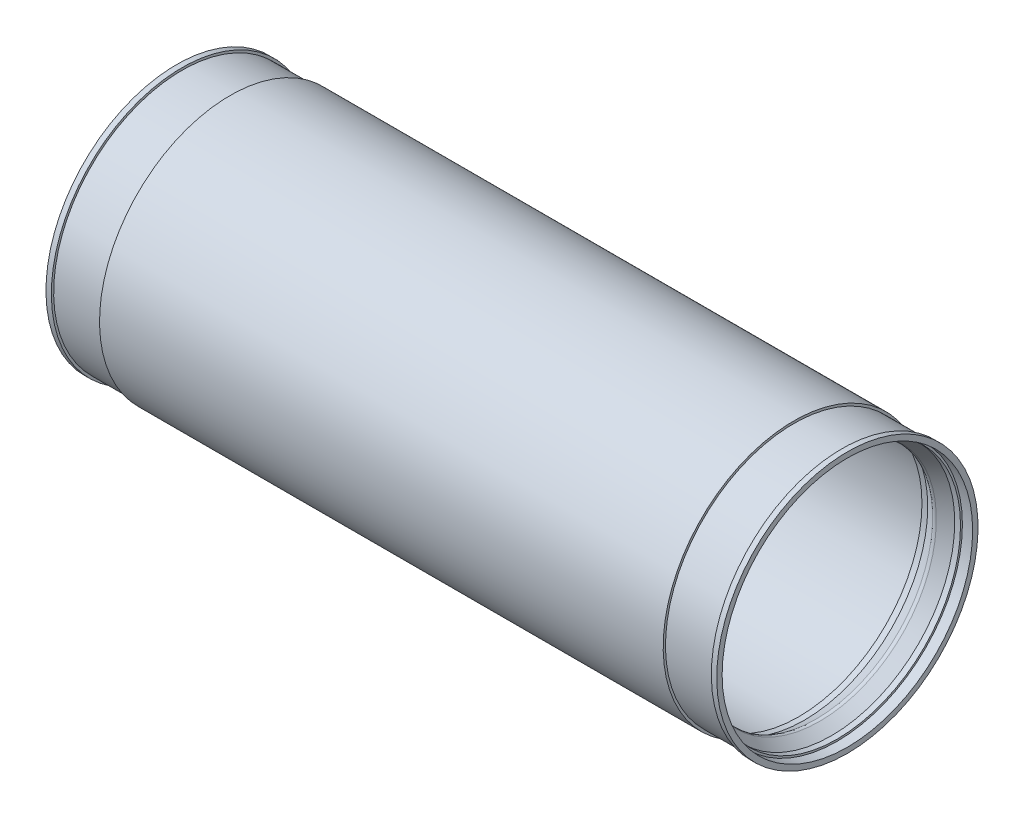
from build123d import *


with BuildPart() as part:
    # Sketch1 → Revolve1 (revolve)
    with BuildSketch(Plane.XY, mode=Mode.PRIVATE) as revolve1_sk:
        with BuildLine():
            Line((32.131, 0), (409.956, 0))
            Line((409.956, 0), (409.956, -1.27))
            Line((409.956, -1.27), (413.766, -1.27))
            Line((413.766, -1.27), (421.423367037, -5.69098292))
            ThreePointArc((421.423367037, -5.69098292), (422.656, -6.021265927), (423.888632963, -5.69098292))
            Line((423.888632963, -5.69098292), (431.546, -1.27))
            Line((431.546, -1.27), (435.356, -1.27))
            Line((435.356, -1.27), (435.356, 0))
            Line((435.356, 0), (442.087, 0))
            Line((442.087, 0), (442.087, 3.556))
            Line((442.087, 3.556), (438.531, 3.556))
            Line((438.531, 3.556), (438.531, 2.032))
            Line((438.531, 2.032), (406.781, 2.032))
            Line((406.781, 2.032), (406.781, 3.556))
            Line((406.781, 3.556), (35.306, 3.556))
            Line((35.306, 3.556), (35.306, 2.032))
            Line((35.306, 2.032), (3.556, 2.032))
            Line((3.556, 2.032), (3.556, 3.556))
            Line((3.556, 3.556), (0, 3.556))
            Line((0, 3.556), (0, 0))
            Line((0, 0), (6.73368093, 0))
            Line((6.73368093, 0), (6.73368093, -1.264356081))
            Line((6.73368093, -1.264356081), (10.54368093, -1.264356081))
            Line((10.54368093, -1.264356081), (18.068716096, -6.199043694))
            ThreePointArc((18.068716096, -6.199043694), (19.468017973, -6.505935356), (20.859783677, -6.166499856))
            Line((20.859783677, -6.166499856), (28.498139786, -2.31739355))
            Line((28.498139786, -2.31739355), (32.131, -2.31739355))
            Line((32.131, -2.31739355), (32.131, 0))
        make_face()
    revolve(revolve1_sk.sketch.rotate(Axis((-16.013386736, -82.55, 0), (1, 0, 0)), 180), axis=Axis((-16.013386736, -82.55, 0), (1, 0, 0)))


solid = part.part
